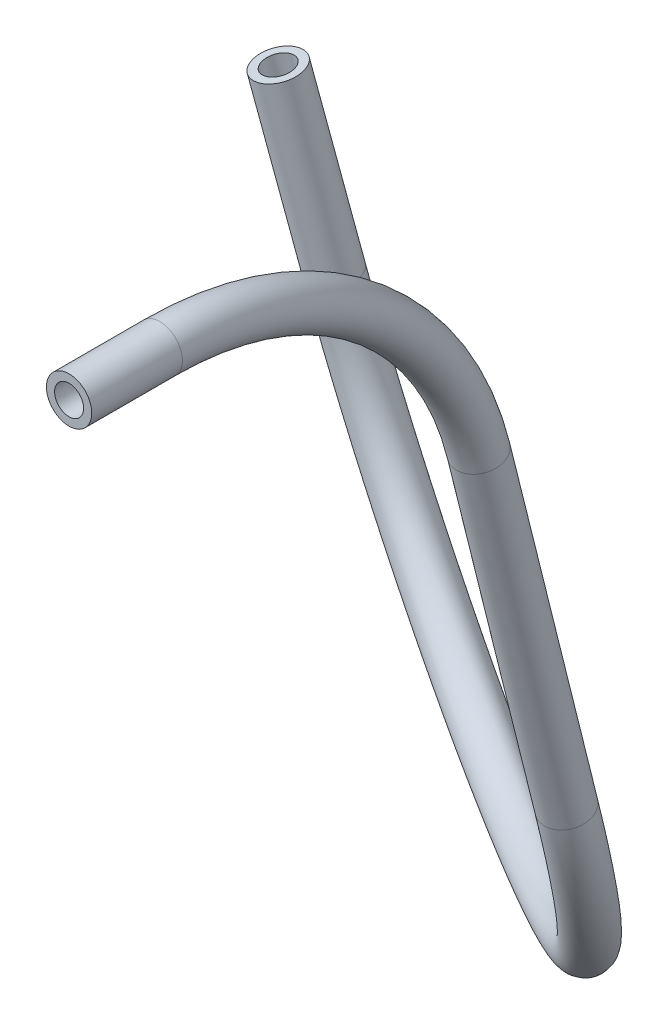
ISO-10303-21;
HEADER;
FILE_DESCRIPTION(('STEP AP214'),'2;1');
FILE_NAME('part.step','',(''),(''),'','','');
FILE_SCHEMA(('AUTOMOTIVE_DESIGN { 1 0 10303 214 1 1 1 1 }'));
ENDSEC;
DATA;
#1=APPLICATION_CONTEXT('core data for automotive mechanical design processes');
#2=APPLICATION_PROTOCOL_DEFINITION('international standard','automotive_design',2000,#1);
#3=PRODUCT_CONTEXT('',#1,'mechanical');
#4=PRODUCT('Part','Part','',(#3));
#5=PRODUCT_RELATED_PRODUCT_CATEGORY('part','',(#4));
#6=PRODUCT_DEFINITION_FORMATION('','',#4);
#7=PRODUCT_DEFINITION_CONTEXT('part definition',#1,'design');
#8=PRODUCT_DEFINITION('design','',#6,#7);
#9=PRODUCT_DEFINITION_SHAPE('','',#8);
#10=(LENGTH_UNIT() NAMED_UNIT(*) SI_UNIT(.MILLI.,.METRE.));
#11=(NAMED_UNIT(*) PLANE_ANGLE_UNIT() SI_UNIT($,.RADIAN.));
#12=(NAMED_UNIT(*) SI_UNIT($,.STERADIAN.) SOLID_ANGLE_UNIT());
#13=UNCERTAINTY_MEASURE_WITH_UNIT(LENGTH_MEASURE(1.E-05),#10,'distance_accuracy_value','');
#14=(GEOMETRIC_REPRESENTATION_CONTEXT(3) GLOBAL_UNCERTAINTY_ASSIGNED_CONTEXT((#13)) GLOBAL_UNIT_ASSIGNED_CONTEXT((#10,
#11,#12)) REPRESENTATION_CONTEXT('',''));
#15=CARTESIAN_POINT('',(0.,0.,0.));
#16=DIRECTION('',(0.,0.,1.));
#17=DIRECTION('',(1.,0.,0.));
#18=AXIS2_PLACEMENT_3D('',#15,#16,#17);
#19=CARTESIAN_POINT('',(0.,-17.4500103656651,-28.6849947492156));
#20=DIRECTION('',(0.,-0.970295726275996,-0.241921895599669));
#21=DIRECTION('',(0.,0.241921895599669,-0.970295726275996));
#22=AXIS2_PLACEMENT_3D('',#19,#20,#21);
#23=CYLINDRICAL_SURFACE('',#22,1.5875);
#24=CARTESIAN_POINT('',(0.,-17.4500103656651,-28.6849947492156));
#25=DIRECTION('',(0.,0.970295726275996,0.241921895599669));
#26=DIRECTION('',(1.,0.,0.));
#27=AXIS2_PLACEMENT_3D('',#24,#25,#26);
#28=CIRCLE('',#27,1.5875);
#29=CARTESIAN_POINT('',(0.,-17.0659593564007,-30.2253392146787));
#30=VERTEX_POINT('',#29);
#31=EDGE_CURVE('E42',#30,#30,#28,.T.);
#32=ORIENTED_EDGE('',*,*,#31,.F.);
#33=EDGE_LOOP('',(#32));
#34=FACE_BOUND('',#33,.T.);
#35=CARTESIAN_POINT('',(0.,-42.0955218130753,-34.8298108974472));
#36=DIRECTION('',(0.,0.970295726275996,0.241921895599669));
#37=DIRECTION('',(1.,0.,0.));
#38=AXIS2_PLACEMENT_3D('',#35,#36,#37);
#39=CIRCLE('',#38,1.5875);
#40=CARTESIAN_POINT('',(1.37481532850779,-42.2875473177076,-34.0596386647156));
#41=VERTEX_POINT('',#40);
#42=EDGE_CURVE('E10',#41,#41,#39,.T.);
#43=ORIENTED_EDGE('',*,*,#42,.T.);
#44=EDGE_LOOP('',(#43));
#45=FACE_BOUND('',#44,.T.);
#46=ADVANCED_FACE('F32',(#34,#45),#23,.T.);
#47=CARTESIAN_POINT('',(0.,-17.4500103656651,-28.6849947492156));
#48=DIRECTION('',(0.,-0.970295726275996,-0.241921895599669));
#49=DIRECTION('',(0.,0.241921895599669,-0.970295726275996));
#50=AXIS2_PLACEMENT_3D('',#47,#48,#49);
#51=CYLINDRICAL_SURFACE('',#50,1.016);
#52=CARTESIAN_POINT('',(0.,-17.4500103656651,-28.6849947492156));
#53=DIRECTION('',(0.,0.970295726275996,0.241921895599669));
#54=DIRECTION('',(1.,0.,0.));
#55=AXIS2_PLACEMENT_3D('',#52,#53,#54);
#56=CIRCLE('',#55,1.016);
#57=CARTESIAN_POINT('',(0.,-17.2042177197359,-29.670815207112));
#58=VERTEX_POINT('',#57);
#59=EDGE_CURVE('E46',#58,#58,#56,.T.);
#60=ORIENTED_EDGE('',*,*,#59,.T.);
#61=EDGE_LOOP('',(#60));
#62=FACE_BOUND('',#61,.T.);
#63=CARTESIAN_POINT('',(0.,-42.0955218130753,-34.8298108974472));
#64=DIRECTION('',(0.,0.970295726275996,0.241921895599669));
#65=DIRECTION('',(1.,0.,0.));
#66=AXIS2_PLACEMENT_3D('',#63,#64,#65);
#67=CIRCLE('',#66,1.016);
#68=CARTESIAN_POINT('',(0.879881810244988,-42.21841813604,-34.336900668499));
#69=VERTEX_POINT('',#68);
#70=EDGE_CURVE('E38',#69,#69,#67,.T.);
#71=ORIENTED_EDGE('',*,*,#70,.F.);
#72=EDGE_LOOP('',(#71));
#73=FACE_BOUND('',#72,.T.);
#74=ADVANCED_FACE('F96',(#62,#73),#51,.F.);
#75=CARTESIAN_POINT('',(0.,-23.01875,-6.35000000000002));
#76=DIRECTION('',(-1.,0.,0.));
#77=DIRECTION('',(0.,0.,1.));
#78=AXIS2_PLACEMENT_3D('',#75,#76,#77);
#79=TOROIDAL_SURFACE('',#78,23.01875,1.5875);
#80=CARTESIAN_POINT('',(0.,0.,-6.35000000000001));
#81=DIRECTION('',(0.,0.,1.));
#82=DIRECTION('',(1.,0.,0.));
#83=AXIS2_PLACEMENT_3D('',#80,#81,#82);
#84=CIRCLE('',#83,1.5875);
#85=CARTESIAN_POINT('',(0.,1.5875,-6.35000000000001));
#86=VERTEX_POINT('',#85);
#87=EDGE_CURVE('E51',#86,#86,#84,.T.);
#88=CARTESIAN_POINT('',(0.,-23.01875,-6.35000000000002));
#89=DIRECTION('',(-1.,0.,0.));
#90=DIRECTION('',(0.,0.,1.));
#91=AXIS2_PLACEMENT_3D('',#88,#89,#90);
#92=CIRCLE('',#91,24.60625);
#93=EDGE_CURVE('',#86,#30,#92,.T.);
#94=ORIENTED_EDGE('',*,*,#87,.F.);
#95=ORIENTED_EDGE('',*,*,#31,.T.);
#96=ORIENTED_EDGE('',*,*,#93,.T.);
#97=ORIENTED_EDGE('',*,*,#93,.F.);
#98=EDGE_LOOP('',(#94,#96,#95,#97));
#99=FACE_BOUND('',#98,.T.);
#100=ADVANCED_FACE('F101',(#99),#79,.T.);
#101=CARTESIAN_POINT('',(0.,-23.01875,-6.35000000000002));
#102=DIRECTION('',(-1.,0.,0.));
#103=DIRECTION('',(0.,0.,1.));
#104=AXIS2_PLACEMENT_3D('',#101,#102,#103);
#105=TOROIDAL_SURFACE('',#104,23.01875,1.016);
#106=CARTESIAN_POINT('',(0.,0.,-6.35000000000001));
#107=DIRECTION('',(0.,0.,1.));
#108=DIRECTION('',(1.,0.,0.));
#109=AXIS2_PLACEMENT_3D('',#106,#107,#108);
#110=CIRCLE('',#109,1.016);
#111=CARTESIAN_POINT('',(0.,1.016,-6.35000000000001));
#112=VERTEX_POINT('',#111);
#113=EDGE_CURVE('E55',#112,#112,#110,.T.);
#114=CARTESIAN_POINT('',(0.,-23.01875,-6.35000000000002));
#115=DIRECTION('',(-1.,0.,0.));
#116=DIRECTION('',(0.,0.,1.));
#117=AXIS2_PLACEMENT_3D('',#114,#115,#116);
#118=CIRCLE('',#117,24.03475);
#119=EDGE_CURVE('',#112,#58,#118,.T.);
#120=ORIENTED_EDGE('',*,*,#113,.T.);
#121=ORIENTED_EDGE('',*,*,#59,.F.);
#122=ORIENTED_EDGE('',*,*,#119,.T.);
#123=ORIENTED_EDGE('',*,*,#119,.F.);
#124=EDGE_LOOP('',(#120,#122,#121,#123));
#125=FACE_BOUND('',#124,.T.);
#126=ADVANCED_FACE('F106',(#125),#105,.F.);
#127=CARTESIAN_POINT('',(0.,0.,-6.35000000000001));
#128=DIRECTION('',(0.,0.,1.));
#129=DIRECTION('',(0.,-1.,0.));
#130=AXIS2_PLACEMENT_3D('',#127,#128,#129);
#131=CYLINDRICAL_SURFACE('',#130,1.016);
#132=ORIENTED_EDGE('',*,*,#113,.F.);
#133=EDGE_LOOP('',(#132));
#134=FACE_BOUND('',#133,.T.);
#135=CARTESIAN_POINT('',(0.,0.,0.));
#136=DIRECTION('',(0.,0.,1.));
#137=DIRECTION('',(1.,0.,0.));
#138=AXIS2_PLACEMENT_3D('',#135,#136,#137);
#139=CIRCLE('',#138,1.016);
#140=CARTESIAN_POINT('',(1.016,0.,0.));
#141=VERTEX_POINT('',#140);
#142=EDGE_CURVE('E56',#141,#141,#139,.T.);
#143=ORIENTED_EDGE('',*,*,#142,.T.);
#144=EDGE_LOOP('',(#143));
#145=FACE_BOUND('',#144,.T.);
#146=ADVANCED_FACE('F112',(#134,#145),#131,.F.);
#147=CARTESIAN_POINT('',(0.,0.,-6.35000000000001));
#148=DIRECTION('',(0.,0.,1.));
#149=DIRECTION('',(0.,-1.,0.));
#150=AXIS2_PLACEMENT_3D('',#147,#148,#149);
#151=CYLINDRICAL_SURFACE('',#150,1.5875);
#152=ORIENTED_EDGE('',*,*,#87,.T.);
#153=EDGE_LOOP('',(#152));
#154=FACE_BOUND('',#153,.T.);
#155=CARTESIAN_POINT('',(0.,0.,0.));
#156=DIRECTION('',(0.,0.,1.));
#157=DIRECTION('',(1.,0.,0.));
#158=AXIS2_PLACEMENT_3D('',#155,#156,#157);
#159=CIRCLE('',#158,1.5875);
#160=CARTESIAN_POINT('',(1.5875,0.,0.));
#161=VERTEX_POINT('',#160);
#162=EDGE_CURVE('E52',#161,#161,#159,.T.);
#163=ORIENTED_EDGE('',*,*,#162,.F.);
#164=EDGE_LOOP('',(#163));
#165=FACE_BOUND('',#164,.T.);
#166=ADVANCED_FACE('F119',(#154,#165),#151,.T.);
#167=CARTESIAN_POINT('',(0.,0.,0.));
#168=DIRECTION('',(0.,0.,1.));
#169=DIRECTION('',(1.,0.,0.));
#170=AXIS2_PLACEMENT_3D('',#167,#168,#169);
#171=PLANE('',#170);
#172=ORIENTED_EDGE('',*,*,#142,.F.);
#173=EDGE_LOOP('',(#172));
#174=FACE_BOUND('',#173,.T.);
#175=ORIENTED_EDGE('',*,*,#162,.T.);
#176=EDGE_LOOP('',(#175));
#177=FACE_BOUND('',#176,.T.);
#178=ADVANCED_FACE('F123',(#174,#177),#171,.T.);
#179=CARTESIAN_POINT('',(-19.8592181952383,-39.3217118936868,-45.9549548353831));
#180=DIRECTION('',(-0.499999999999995,-0.209510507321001,0.840300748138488));
#181=DIRECTION('',(0.859373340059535,0.,0.511348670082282));
#182=AXIS2_PLACEMENT_3D('',#179,#180,#181);
#183=TOROIDAL_SURFACE('',#182,22.9314499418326,1.01600000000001);
#184=CARTESIAN_POINT('',(-39.3535666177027,-40.8444197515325,-57.9342343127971));
#185=DIRECTION('',(-0.165245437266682,0.975549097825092,0.144906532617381));
#186=DIRECTION('',(0.858069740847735,0.21464272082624,-0.466524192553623));
#187=AXIS2_PLACEMENT_3D('',#184,#185,#186);
#188=CIRCLE('',#187,1.01600000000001);
#189=CARTESIAN_POINT('',(-40.2172825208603,-40.9118847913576,-58.4649878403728));
#190=VERTEX_POINT('',#189);
#191=EDGE_CURVE('E66',#190,#190,#188,.T.);
#192=CARTESIAN_POINT('',(-19.8592181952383,-39.3217118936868,-45.9549548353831));
#193=DIRECTION('',(-0.499999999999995,-0.209510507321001,0.840300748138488));
#194=DIRECTION('',(0.859373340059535,0.,0.511348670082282));
#195=AXIS2_PLACEMENT_3D('',#192,#193,#194);
#196=CIRCLE('',#195,23.9474499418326);
#197=EDGE_CURVE('',#190,#69,#196,.T.);
#198=ORIENTED_EDGE('',*,*,#191,.T.);
#199=ORIENTED_EDGE('',*,*,#70,.T.);
#200=ORIENTED_EDGE('',*,*,#197,.T.);
#201=ORIENTED_EDGE('',*,*,#197,.F.);
#202=EDGE_LOOP('',(#198,#200,#199,#201));
#203=FACE_BOUND('',#202,.T.);
#204=ADVANCED_FACE('F91',(#203),#183,.F.);
#205=CARTESIAN_POINT('',(-19.8592181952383,-39.3217118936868,-45.9549548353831));
#206=DIRECTION('',(-0.499999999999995,-0.209510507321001,0.840300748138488));
#207=DIRECTION('',(0.859373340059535,0.,0.511348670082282));
#208=AXIS2_PLACEMENT_3D('',#205,#206,#207);
#209=TOROIDAL_SURFACE('',#208,22.9314499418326,1.5875);
#210=CARTESIAN_POINT('',(-39.3535666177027,-40.8444197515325,-57.9342343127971));
#211=DIRECTION('',(-0.165245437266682,0.975549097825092,0.144906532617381));
#212=DIRECTION('',(0.858069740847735,0.21464272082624,-0.466524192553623));
#213=AXIS2_PLACEMENT_3D('',#210,#211,#212);
#214=CIRCLE('',#213,1.5875);
#215=CARTESIAN_POINT('',(-40.7031227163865,-40.9498338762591,-58.7635366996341));
#216=VERTEX_POINT('',#215);
#217=EDGE_CURVE('E59',#216,#216,#214,.T.);
#218=CARTESIAN_POINT('',(-19.8592181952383,-39.3217118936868,-45.9549548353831));
#219=DIRECTION('',(-0.499999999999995,-0.209510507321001,0.840300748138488));
#220=DIRECTION('',(0.859373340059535,0.,0.511348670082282));
#221=AXIS2_PLACEMENT_3D('',#218,#219,#220);
#222=CIRCLE('',#221,24.5189499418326);
#223=EDGE_CURVE('',#216,#41,#222,.T.);
#224=ORIENTED_EDGE('',*,*,#217,.F.);
#225=ORIENTED_EDGE('',*,*,#42,.F.);
#226=ORIENTED_EDGE('',*,*,#223,.T.);
#227=ORIENTED_EDGE('',*,*,#223,.F.);
#228=EDGE_LOOP('',(#224,#226,#225,#227));
#229=FACE_BOUND('',#228,.T.);
#230=ADVANCED_FACE('F82',(#229),#209,.T.);
#231=CARTESIAN_POINT('',(-41.4521836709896,-28.4549462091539,-56.0939213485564));
#232=DIRECTION('',(-0.165245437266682,0.975549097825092,0.144906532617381));
#233=DIRECTION('',(-0.985955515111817,-0.167008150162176,0.));
#234=AXIS2_PLACEMENT_3D('',#231,#232,#233);
#235=PLANE('',#234);
#236=CARTESIAN_POINT('',(-41.4521836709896,-28.4549462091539,-56.0939213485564));
#237=DIRECTION('',(-0.165245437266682,0.975549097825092,0.144906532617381));
#238=DIRECTION('',(-0.985955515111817,-0.167008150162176,0.));
#239=AXIS2_PLACEMENT_3D('',#236,#237,#238);
#240=CIRCLE('',#239,1.5875);
#241=CARTESIAN_POINT('',(-43.0173880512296,-28.7200716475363,-56.0939213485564));
#242=VERTEX_POINT('',#241);
#243=EDGE_CURVE('E69',#242,#242,#240,.T.);
#244=ORIENTED_EDGE('',*,*,#243,.T.);
#245=EDGE_LOOP('',(#244));
#246=FACE_BOUND('',#245,.T.);
#247=CARTESIAN_POINT('',(-41.4521836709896,-28.4549462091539,-56.0939213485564));
#248=DIRECTION('',(-0.165245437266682,0.975549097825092,0.144906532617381));
#249=DIRECTION('',(-0.985955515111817,-0.167008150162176,0.));
#250=AXIS2_PLACEMENT_3D('',#247,#248,#249);
#251=CIRCLE('',#250,1.016);
#252=CARTESIAN_POINT('',(-42.4539144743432,-28.6246264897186,-56.0939213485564));
#253=VERTEX_POINT('',#252);
#254=EDGE_CURVE('E72',#253,#253,#251,.T.);
#255=ORIENTED_EDGE('',*,*,#254,.F.);
#256=EDGE_LOOP('',(#255));
#257=FACE_BOUND('',#256,.T.);
#258=ADVANCED_FACE('F79',(#246,#257),#235,.T.);
#259=CARTESIAN_POINT('',(-41.4521836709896,-28.4549462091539,-56.0939213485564));
#260=DIRECTION('',(0.165245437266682,-0.975549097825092,-0.144906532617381));
#261=DIRECTION('',(0.985955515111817,0.167008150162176,0.));
#262=AXIS2_PLACEMENT_3D('',#259,#260,#261);
#263=CYLINDRICAL_SURFACE('',#262,1.5875);
#264=ORIENTED_EDGE('',*,*,#243,.F.);
#265=EDGE_LOOP('',(#264));
#266=FACE_BOUND('',#265,.T.);
#267=ORIENTED_EDGE('',*,*,#217,.T.);
#268=EDGE_LOOP('',(#267));
#269=FACE_BOUND('',#268,.T.);
#270=ADVANCED_FACE('F81',(#266,#269),#263,.T.);
#271=CARTESIAN_POINT('',(-41.4521836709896,-28.4549462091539,-56.0939213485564));
#272=DIRECTION('',(0.165245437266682,-0.975549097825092,-0.144906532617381));
#273=DIRECTION('',(0.985955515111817,0.167008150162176,0.));
#274=AXIS2_PLACEMENT_3D('',#271,#272,#273);
#275=CYLINDRICAL_SURFACE('',#274,1.016);
#276=ORIENTED_EDGE('',*,*,#254,.T.);
#277=EDGE_LOOP('',(#276));
#278=FACE_BOUND('',#277,.T.);
#279=ORIENTED_EDGE('',*,*,#191,.F.);
#280=EDGE_LOOP('',(#279));
#281=FACE_BOUND('',#280,.T.);
#282=ADVANCED_FACE('F76',(#278,#281),#275,.F.);
#283=CLOSED_SHELL('',(#46,#74,#100,#126,#146,#166,#178,#204,#230,#258,#270,#282));
#284=MANIFOLD_SOLID_BREP('B2',#283);
#285=ADVANCED_BREP_SHAPE_REPRESENTATION('',(#18,#284),#14);
#286=SHAPE_DEFINITION_REPRESENTATION(#9,#285);
ENDSEC;
END-ISO-10303-21;
